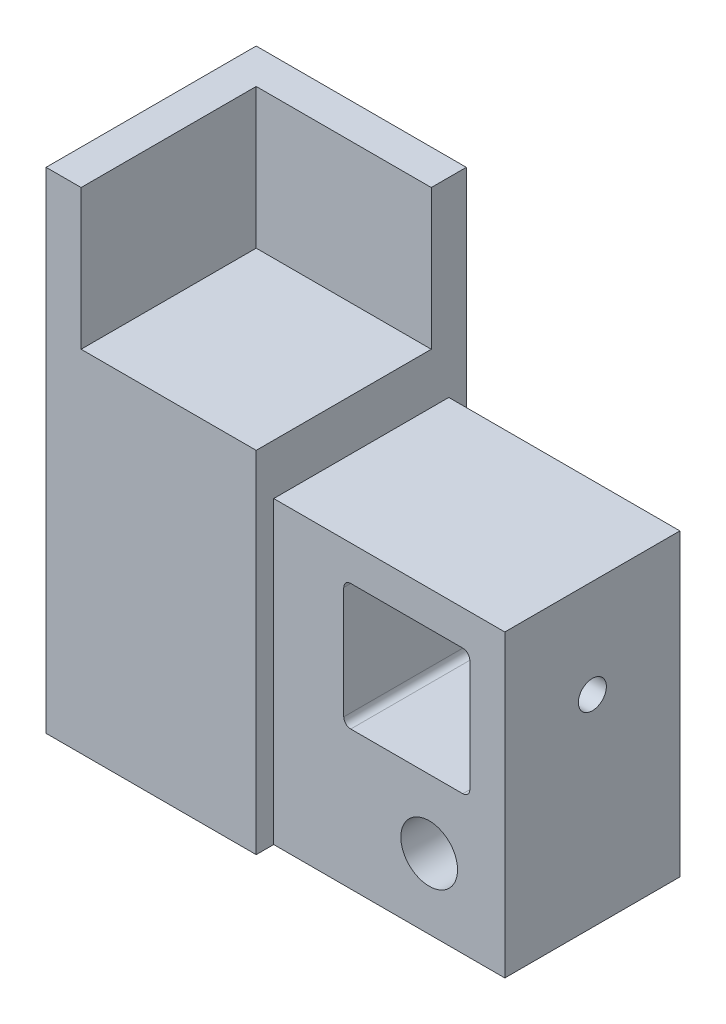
ISO-10303-21;
HEADER;
FILE_DESCRIPTION(('STEP AP214'),'2;1');
FILE_NAME('part.step','',(''),(''),'','','');
FILE_SCHEMA(('AUTOMOTIVE_DESIGN { 1 0 10303 214 1 1 1 1 }'));
ENDSEC;
DATA;
#1=APPLICATION_CONTEXT('core data for automotive mechanical design processes');
#2=APPLICATION_PROTOCOL_DEFINITION('international standard','automotive_design',2000,#1);
#3=PRODUCT_CONTEXT('',#1,'mechanical');
#4=PRODUCT('Part','Part','',(#3));
#5=PRODUCT_RELATED_PRODUCT_CATEGORY('part','',(#4));
#6=PRODUCT_DEFINITION_FORMATION('','',#4);
#7=PRODUCT_DEFINITION_CONTEXT('part definition',#1,'design');
#8=PRODUCT_DEFINITION('design','',#6,#7);
#9=PRODUCT_DEFINITION_SHAPE('','',#8);
#10=(LENGTH_UNIT() NAMED_UNIT(*) SI_UNIT(.MILLI.,.METRE.));
#11=(NAMED_UNIT(*) PLANE_ANGLE_UNIT() SI_UNIT($,.RADIAN.));
#12=(NAMED_UNIT(*) SI_UNIT($,.STERADIAN.) SOLID_ANGLE_UNIT());
#13=UNCERTAINTY_MEASURE_WITH_UNIT(LENGTH_MEASURE(1.E-05),#10,'distance_accuracy_value','');
#14=(GEOMETRIC_REPRESENTATION_CONTEXT(3) GLOBAL_UNCERTAINTY_ASSIGNED_CONTEXT((#13)) GLOBAL_UNIT_ASSIGNED_CONTEXT((#10,
#11,#12)) REPRESENTATION_CONTEXT('',''));
#15=CARTESIAN_POINT('',(0.,0.,0.));
#16=DIRECTION('',(0.,0.,1.));
#17=DIRECTION('',(1.,0.,0.));
#18=AXIS2_PLACEMENT_3D('',#15,#16,#17);
#19=CARTESIAN_POINT('',(0.,50.,0.));
#20=DIRECTION('',(0.,-1.,0.));
#21=DIRECTION('',(0.,0.,-1.));
#22=AXIS2_PLACEMENT_3D('',#19,#20,#21);
#23=PLANE('',#22);
#24=DIRECTION('',(1.,0.,0.));
#25=VECTOR('',#24,1.);
#26=CARTESIAN_POINT('',(15.,50.,-9.99999999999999));
#27=LINE('',#26,#25);
#28=CARTESIAN_POINT('',(-10.,50.,-9.99999999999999));
#29=VERTEX_POINT('',#28);
#30=CARTESIAN_POINT('',(15.,50.,-9.99999999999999));
#31=VERTEX_POINT('',#30);
#32=EDGE_CURVE('E221',#29,#31,#27,.T.);
#33=ORIENTED_EDGE('',*,*,#32,.F.);
#34=DIRECTION('',(0.,0.,-1.));
#35=VECTOR('',#34,1.);
#36=CARTESIAN_POINT('',(-10.,50.,-9.99999999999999));
#37=LINE('',#36,#35);
#38=CARTESIAN_POINT('',(-10.,50.,15.));
#39=VERTEX_POINT('',#38);
#40=EDGE_CURVE('E57',#39,#29,#37,.T.);
#41=ORIENTED_EDGE('',*,*,#40,.F.);
#42=DIRECTION('',(1.,0.,0.));
#43=VECTOR('',#42,1.);
#44=CARTESIAN_POINT('',(-15.,50.,15.));
#45=LINE('',#44,#43);
#46=CARTESIAN_POINT('',(15.,50.,15.));
#47=VERTEX_POINT('',#46);
#48=EDGE_CURVE('E340',#39,#47,#45,.T.);
#49=ORIENTED_EDGE('',*,*,#48,.T.);
#50=DIRECTION('',(0.,0.,-1.));
#51=VECTOR('',#50,1.);
#52=CARTESIAN_POINT('',(15.,50.,15.));
#53=LINE('',#52,#51);
#54=EDGE_CURVE('E62',#47,#31,#53,.T.);
#55=ORIENTED_EDGE('',*,*,#54,.T.);
#56=EDGE_LOOP('',(#33,#41,#49,#55));
#57=FACE_BOUND('',#56,.T.);
#58=ADVANCED_FACE('F40',(#57),#23,.F.);
#59=CARTESIAN_POINT('',(37.2,9.99999999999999,-12.5));
#60=DIRECTION('',(0.,0.,1.));
#61=DIRECTION('',(1.,0.,0.));
#62=AXIS2_PLACEMENT_3D('',#59,#60,#61);
#63=CYLINDRICAL_SURFACE('',#62,4.05);
#64=CARTESIAN_POINT('',(37.2,9.99999999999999,12.5));
#65=DIRECTION('',(0.,0.,1.));
#66=DIRECTION('',(1.,0.,0.));
#67=AXIS2_PLACEMENT_3D('',#64,#65,#66);
#68=CIRCLE('',#67,4.05);
#69=CARTESIAN_POINT('',(41.25,9.99999999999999,12.5));
#70=VERTEX_POINT('',#69);
#71=EDGE_CURVE('E263',#70,#70,#68,.T.);
#72=ORIENTED_EDGE('',*,*,#71,.T.);
#73=EDGE_LOOP('',(#72));
#74=FACE_BOUND('',#73,.T.);
#75=CARTESIAN_POINT('',(37.2,9.99999999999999,5.));
#76=DIRECTION('',(0.,0.,-1.));
#77=DIRECTION('',(-1.,0.,0.));
#78=AXIS2_PLACEMENT_3D('',#75,#76,#77);
#79=CIRCLE('',#78,4.05);
#80=CARTESIAN_POINT('',(33.15,9.99999999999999,5.));
#81=VERTEX_POINT('',#80);
#82=EDGE_CURVE('E13',#81,#81,#79,.F.);
#83=ORIENTED_EDGE('',*,*,#82,.F.);
#84=EDGE_LOOP('',(#83));
#85=FACE_BOUND('',#84,.T.);
#86=ADVANCED_FACE('F411',(#74,#85),#63,.F.);
#87=CARTESIAN_POINT('',(15.,50.,15.));
#88=DIRECTION('',(-1.,0.,0.));
#89=DIRECTION('',(0.,0.,1.));
#90=AXIS2_PLACEMENT_3D('',#87,#88,#89);
#91=PLANE('',#90);
#92=DIRECTION('',(0.,-1.,0.));
#93=VECTOR('',#92,1.);
#94=CARTESIAN_POINT('',(15.,42.79,12.5));
#95=LINE('',#94,#93);
#96=CARTESIAN_POINT('',(15.,42.79,12.5));
#97=VERTEX_POINT('',#96);
#98=CARTESIAN_POINT('',(15.,0.,12.5));
#99=VERTEX_POINT('',#98);
#100=EDGE_CURVE('E269',#97,#99,#95,.T.);
#101=ORIENTED_EDGE('',*,*,#100,.F.);
#102=DIRECTION('',(0.,0.,1.));
#103=VECTOR('',#102,1.);
#104=CARTESIAN_POINT('',(15.,42.79,-12.5));
#105=LINE('',#104,#103);
#106=CARTESIAN_POINT('',(15.,42.79,-12.5));
#107=VERTEX_POINT('',#106);
#108=EDGE_CURVE('E304',#107,#97,#105,.T.);
#109=ORIENTED_EDGE('',*,*,#108,.F.);
#110=DIRECTION('',(0.,-1.,0.));
#111=VECTOR('',#110,1.);
#112=CARTESIAN_POINT('',(15.,42.79,-12.5));
#113=LINE('',#112,#111);
#114=CARTESIAN_POINT('',(15.,0.,-12.5));
#115=VERTEX_POINT('',#114);
#116=EDGE_CURVE('E295',#107,#115,#113,.T.);
#117=ORIENTED_EDGE('',*,*,#116,.T.);
#118=DIRECTION('',(0.,0.,-1.));
#119=VECTOR('',#118,1.);
#120=CARTESIAN_POINT('',(15.,0.,15.));
#121=LINE('',#120,#119);
#122=CARTESIAN_POINT('',(15.,0.,-15.));
#123=VERTEX_POINT('',#122);
#124=EDGE_CURVE('E338',#115,#123,#121,.T.);
#125=ORIENTED_EDGE('',*,*,#124,.T.);
#126=DIRECTION('',(0.,-1.,0.));
#127=VECTOR('',#126,1.);
#128=CARTESIAN_POINT('',(15.,50.,-15.));
#129=LINE('',#128,#127);
#130=CARTESIAN_POINT('',(15.,70.,-15.));
#131=VERTEX_POINT('',#130);
#132=EDGE_CURVE('E206',#131,#123,#129,.T.);
#133=ORIENTED_EDGE('',*,*,#132,.F.);
#134=DIRECTION('',(0.,0.,-1.));
#135=VECTOR('',#134,1.);
#136=CARTESIAN_POINT('',(15.,70.,-15.));
#137=LINE('',#136,#135);
#138=CARTESIAN_POINT('',(15.,70.,-9.99999999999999));
#139=VERTEX_POINT('',#138);
#140=EDGE_CURVE('E220',#139,#131,#137,.T.);
#141=ORIENTED_EDGE('',*,*,#140,.F.);
#142=DIRECTION('',(0.,-1.,0.));
#143=VECTOR('',#142,1.);
#144=CARTESIAN_POINT('',(15.,70.,-9.99999999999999));
#145=LINE('',#144,#143);
#146=EDGE_CURVE('E231',#139,#31,#145,.T.);
#147=ORIENTED_EDGE('',*,*,#146,.T.);
#148=ORIENTED_EDGE('',*,*,#54,.F.);
#149=DIRECTION('',(0.,-1.,0.));
#150=VECTOR('',#149,1.);
#151=CARTESIAN_POINT('',(15.,50.,15.));
#152=LINE('',#151,#150);
#153=CARTESIAN_POINT('',(15.,0.,15.));
#154=VERTEX_POINT('',#153);
#155=EDGE_CURVE('E343',#47,#154,#152,.T.);
#156=ORIENTED_EDGE('',*,*,#155,.T.);
#157=EDGE_CURVE('E344',#154,#99,#121,.T.);
#158=ORIENTED_EDGE('',*,*,#157,.T.);
#159=EDGE_LOOP('',(#101,#109,#117,#125,#133,#141,#147,#148,#156,#158));
#160=FACE_BOUND('',#159,.T.);
#161=ADVANCED_FACE('F418',(#160),#91,.F.);
#162=CARTESIAN_POINT('',(-15.,50.,-15.));
#163=DIRECTION('',(0.,0.,1.));
#164=DIRECTION('',(1.,0.,0.));
#165=AXIS2_PLACEMENT_3D('',#162,#163,#164);
#166=PLANE('',#165);
#167=DIRECTION('',(-1.,0.,0.));
#168=VECTOR('',#167,1.);
#169=CARTESIAN_POINT('',(-15.,0.,-15.));
#170=LINE('',#169,#168);
#171=CARTESIAN_POINT('',(-15.,0.,-15.));
#172=VERTEX_POINT('',#171);
#173=EDGE_CURVE('E203',#123,#172,#170,.T.);
#174=ORIENTED_EDGE('',*,*,#173,.T.);
#175=DIRECTION('',(0.,-1.,0.));
#176=VECTOR('',#175,1.);
#177=CARTESIAN_POINT('',(-15.,50.,-15.));
#178=LINE('',#177,#176);
#179=CARTESIAN_POINT('',(-15.,70.,-15.));
#180=VERTEX_POINT('',#179);
#181=EDGE_CURVE('E196',#180,#172,#178,.T.);
#182=ORIENTED_EDGE('',*,*,#181,.F.);
#183=DIRECTION('',(-1.,0.,0.));
#184=VECTOR('',#183,1.);
#185=CARTESIAN_POINT('',(15.,70.,-15.));
#186=LINE('',#185,#184);
#187=EDGE_CURVE('E201',#131,#180,#186,.T.);
#188=ORIENTED_EDGE('',*,*,#187,.F.);
#189=ORIENTED_EDGE('',*,*,#132,.T.);
#190=EDGE_LOOP('',(#174,#182,#188,#189));
#191=FACE_BOUND('',#190,.T.);
#192=ADVANCED_FACE('F198',(#191),#166,.F.);
#193=CARTESIAN_POINT('',(-15.,50.,15.));
#194=DIRECTION('',(1.,0.,0.));
#195=DIRECTION('',(0.,0.,-1.));
#196=AXIS2_PLACEMENT_3D('',#193,#194,#195);
#197=PLANE('',#196);
#198=DIRECTION('',(0.,0.,1.));
#199=VECTOR('',#198,1.);
#200=CARTESIAN_POINT('',(-15.,0.,15.));
#201=LINE('',#200,#199);
#202=CARTESIAN_POINT('',(-15.,0.,15.));
#203=VERTEX_POINT('',#202);
#204=EDGE_CURVE('E348',#172,#203,#201,.T.);
#205=ORIENTED_EDGE('',*,*,#204,.T.);
#206=DIRECTION('',(0.,-1.,0.));
#207=VECTOR('',#206,1.);
#208=CARTESIAN_POINT('',(-15.,50.,15.));
#209=LINE('',#208,#207);
#210=CARTESIAN_POINT('',(-15.,70.,15.));
#211=VERTEX_POINT('',#210);
#212=EDGE_CURVE('E207',#211,#203,#209,.T.);
#213=ORIENTED_EDGE('',*,*,#212,.F.);
#214=DIRECTION('',(0.,0.,1.));
#215=VECTOR('',#214,1.);
#216=CARTESIAN_POINT('',(-15.,70.,-15.));
#217=LINE('',#216,#215);
#218=EDGE_CURVE('E210',#180,#211,#217,.T.);
#219=ORIENTED_EDGE('',*,*,#218,.F.);
#220=ORIENTED_EDGE('',*,*,#181,.T.);
#221=EDGE_LOOP('',(#205,#213,#219,#220));
#222=FACE_BOUND('',#221,.T.);
#223=ADVANCED_FACE('F211',(#222),#197,.F.);
#224=CARTESIAN_POINT('',(-15.,50.,15.));
#225=DIRECTION('',(0.,0.,-1.));
#226=DIRECTION('',(-1.,0.,0.));
#227=AXIS2_PLACEMENT_3D('',#224,#225,#226);
#228=PLANE('',#227);
#229=DIRECTION('',(1.,0.,0.));
#230=VECTOR('',#229,1.);
#231=CARTESIAN_POINT('',(-15.,0.,15.));
#232=LINE('',#231,#230);
#233=EDGE_CURVE('E341',#203,#154,#232,.T.);
#234=ORIENTED_EDGE('',*,*,#233,.T.);
#235=ORIENTED_EDGE('',*,*,#155,.F.);
#236=ORIENTED_EDGE('',*,*,#48,.F.);
#237=DIRECTION('',(0.,-1.,0.));
#238=VECTOR('',#237,1.);
#239=CARTESIAN_POINT('',(-10.,70.,15.));
#240=LINE('',#239,#238);
#241=CARTESIAN_POINT('',(-10.,70.,15.));
#242=VERTEX_POINT('',#241);
#243=EDGE_CURVE('E238',#242,#39,#240,.T.);
#244=ORIENTED_EDGE('',*,*,#243,.F.);
#245=DIRECTION('',(1.,0.,0.));
#246=VECTOR('',#245,1.);
#247=CARTESIAN_POINT('',(-10.,70.,15.));
#248=LINE('',#247,#246);
#249=EDGE_CURVE('E215',#211,#242,#248,.T.);
#250=ORIENTED_EDGE('',*,*,#249,.F.);
#251=ORIENTED_EDGE('',*,*,#212,.T.);
#252=EDGE_LOOP('',(#234,#235,#236,#244,#250,#251));
#253=FACE_BOUND('',#252,.T.);
#254=ADVANCED_FACE('F428',(#253),#228,.F.);
#255=CARTESIAN_POINT('',(0.,0.,0.));
#256=DIRECTION('',(0.,-1.,0.));
#257=DIRECTION('',(0.,0.,-1.));
#258=AXIS2_PLACEMENT_3D('',#255,#256,#257);
#259=PLANE('',#258);
#260=DIRECTION('',(0.,0.,1.));
#261=VECTOR('',#260,1.);
#262=CARTESIAN_POINT('',(48.,0.,-12.5));
#263=LINE('',#262,#261);
#264=CARTESIAN_POINT('',(48.,0.,-12.5));
#265=VERTEX_POINT('',#264);
#266=CARTESIAN_POINT('',(48.,0.,12.5));
#267=VERTEX_POINT('',#266);
#268=EDGE_CURVE('E308',#265,#267,#263,.T.);
#269=ORIENTED_EDGE('',*,*,#268,.T.);
#270=DIRECTION('',(1.,0.,0.));
#271=VECTOR('',#270,1.);
#272=CARTESIAN_POINT('',(48.,0.,12.5));
#273=LINE('',#272,#271);
#274=EDGE_CURVE('E271',#99,#267,#273,.T.);
#275=ORIENTED_EDGE('',*,*,#274,.F.);
#276=ORIENTED_EDGE('',*,*,#157,.F.);
#277=ORIENTED_EDGE('',*,*,#233,.F.);
#278=ORIENTED_EDGE('',*,*,#204,.F.);
#279=ORIENTED_EDGE('',*,*,#173,.F.);
#280=ORIENTED_EDGE('',*,*,#124,.F.);
#281=DIRECTION('',(1.,0.,0.));
#282=VECTOR('',#281,1.);
#283=CARTESIAN_POINT('',(48.,0.,-12.5));
#284=LINE('',#283,#282);
#285=EDGE_CURVE('E298',#115,#265,#284,.T.);
#286=ORIENTED_EDGE('',*,*,#285,.T.);
#287=EDGE_LOOP('',(#269,#275,#276,#277,#278,#279,#280,#286));
#288=FACE_BOUND('',#287,.T.);
#289=DIRECTION('',(0.,0.,1.));
#290=VECTOR('',#289,1.);
#291=CARTESIAN_POINT('',(10.,0.,-10.));
#292=LINE('',#291,#290);
#293=CARTESIAN_POINT('',(10.,0.,-10.));
#294=VERTEX_POINT('',#293);
#295=CARTESIAN_POINT('',(10.,0.,10.));
#296=VERTEX_POINT('',#295);
#297=EDGE_CURVE('E307',#294,#296,#292,.T.);
#298=ORIENTED_EDGE('',*,*,#297,.F.);
#299=DIRECTION('',(1.,0.,0.));
#300=VECTOR('',#299,1.);
#301=CARTESIAN_POINT('',(-10.,0.,-10.));
#302=LINE('',#301,#300);
#303=CARTESIAN_POINT('',(-10.,0.,-10.));
#304=VERTEX_POINT('',#303);
#305=EDGE_CURVE('E326',#304,#294,#302,.T.);
#306=ORIENTED_EDGE('',*,*,#305,.F.);
#307=DIRECTION('',(0.,0.,-1.));
#308=VECTOR('',#307,1.);
#309=CARTESIAN_POINT('',(-10.,0.,-10.));
#310=LINE('',#309,#308);
#311=CARTESIAN_POINT('',(-10.,0.,10.));
#312=VERTEX_POINT('',#311);
#313=EDGE_CURVE('E323',#312,#304,#310,.T.);
#314=ORIENTED_EDGE('',*,*,#313,.F.);
#315=DIRECTION('',(-1.,0.,0.));
#316=VECTOR('',#315,1.);
#317=CARTESIAN_POINT('',(-10.,0.,10.));
#318=LINE('',#317,#316);
#319=EDGE_CURVE('E320',#296,#312,#318,.T.);
#320=ORIENTED_EDGE('',*,*,#319,.F.);
#321=EDGE_LOOP('',(#298,#306,#314,#320));
#322=FACE_BOUND('',#321,.T.);
#323=ADVANCED_FACE('F425',(#288,#322),#259,.T.);
#324=CARTESIAN_POINT('',(10.,78.2842712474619,-10.));
#325=DIRECTION('',(1.,0.,0.));
#326=DIRECTION('',(0.,0.,-1.));
#327=AXIS2_PLACEMENT_3D('',#324,#325,#326);
#328=PLANE('',#327);
#329=DIRECTION('',(0.,0.,-1.));
#330=VECTOR('',#329,1.);
#331=CARTESIAN_POINT('',(10.,45.,-10.));
#332=LINE('',#331,#330);
#333=CARTESIAN_POINT('',(10.,45.,10.));
#334=VERTEX_POINT('',#333);
#335=CARTESIAN_POINT('',(10.,45.,-10.));
#336=VERTEX_POINT('',#335);
#337=EDGE_CURVE('E316',#334,#336,#332,.T.);
#338=ORIENTED_EDGE('',*,*,#337,.T.);
#339=DIRECTION('',(0.,-1.,0.));
#340=VECTOR('',#339,1.);
#341=CARTESIAN_POINT('',(10.,78.2842712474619,-10.));
#342=LINE('',#341,#340);
#343=EDGE_CURVE('E314',#336,#294,#342,.T.);
#344=ORIENTED_EDGE('',*,*,#343,.T.);
#345=ORIENTED_EDGE('',*,*,#297,.T.);
#346=DIRECTION('',(0.,-1.,0.));
#347=VECTOR('',#346,1.);
#348=CARTESIAN_POINT('',(10.,78.2842712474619,10.));
#349=LINE('',#348,#347);
#350=EDGE_CURVE('E329',#334,#296,#349,.T.);
#351=ORIENTED_EDGE('',*,*,#350,.F.);
#352=EDGE_LOOP('',(#338,#344,#345,#351));
#353=FACE_BOUND('',#352,.T.);
#354=ADVANCED_FACE('F423',(#353),#328,.F.);
#355=CARTESIAN_POINT('',(-10.,78.2842712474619,-10.));
#356=DIRECTION('',(0.,0.,-1.));
#357=DIRECTION('',(-1.,0.,0.));
#358=AXIS2_PLACEMENT_3D('',#355,#356,#357);
#359=PLANE('',#358);
#360=DIRECTION('',(-1.,0.,0.));
#361=VECTOR('',#360,1.);
#362=CARTESIAN_POINT('',(-10.,45.,-10.));
#363=LINE('',#362,#361);
#364=CARTESIAN_POINT('',(-10.,45.,-10.));
#365=VERTEX_POINT('',#364);
#366=EDGE_CURVE('E313',#336,#365,#363,.T.);
#367=ORIENTED_EDGE('',*,*,#366,.T.);
#368=DIRECTION('',(0.,-1.,0.));
#369=VECTOR('',#368,1.);
#370=CARTESIAN_POINT('',(-10.,78.2842712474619,-10.));
#371=LINE('',#370,#369);
#372=EDGE_CURVE('E331',#365,#304,#371,.T.);
#373=ORIENTED_EDGE('',*,*,#372,.T.);
#374=ORIENTED_EDGE('',*,*,#305,.T.);
#375=ORIENTED_EDGE('',*,*,#343,.F.);
#376=EDGE_LOOP('',(#367,#373,#374,#375));
#377=FACE_BOUND('',#376,.T.);
#378=ADVANCED_FACE('F520',(#377),#359,.F.);
#379=CARTESIAN_POINT('',(-10.,78.2842712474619,-10.));
#380=DIRECTION('',(-1.,0.,0.));
#381=DIRECTION('',(0.,0.,1.));
#382=AXIS2_PLACEMENT_3D('',#379,#380,#381);
#383=PLANE('',#382);
#384=DIRECTION('',(0.,0.,1.));
#385=VECTOR('',#384,1.);
#386=CARTESIAN_POINT('',(-10.,45.,-10.));
#387=LINE('',#386,#385);
#388=CARTESIAN_POINT('',(-10.,45.,10.));
#389=VERTEX_POINT('',#388);
#390=EDGE_CURVE('E311',#365,#389,#387,.T.);
#391=ORIENTED_EDGE('',*,*,#390,.T.);
#392=DIRECTION('',(0.,-1.,0.));
#393=VECTOR('',#392,1.);
#394=CARTESIAN_POINT('',(-10.,78.2842712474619,10.));
#395=LINE('',#394,#393);
#396=EDGE_CURVE('E333',#389,#312,#395,.T.);
#397=ORIENTED_EDGE('',*,*,#396,.T.);
#398=ORIENTED_EDGE('',*,*,#313,.T.);
#399=ORIENTED_EDGE('',*,*,#372,.F.);
#400=EDGE_LOOP('',(#391,#397,#398,#399));
#401=FACE_BOUND('',#400,.T.);
#402=ADVANCED_FACE('F523',(#401),#383,.F.);
#403=CARTESIAN_POINT('',(-10.,78.2842712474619,10.));
#404=DIRECTION('',(0.,0.,1.));
#405=DIRECTION('',(1.,0.,0.));
#406=AXIS2_PLACEMENT_3D('',#403,#404,#405);
#407=PLANE('',#406);
#408=DIRECTION('',(1.,0.,0.));
#409=VECTOR('',#408,1.);
#410=CARTESIAN_POINT('',(-10.,45.,10.));
#411=LINE('',#410,#409);
#412=EDGE_CURVE('E318',#389,#334,#411,.T.);
#413=ORIENTED_EDGE('',*,*,#412,.T.);
#414=ORIENTED_EDGE('',*,*,#350,.T.);
#415=ORIENTED_EDGE('',*,*,#319,.T.);
#416=ORIENTED_EDGE('',*,*,#396,.F.);
#417=EDGE_LOOP('',(#413,#414,#415,#416));
#418=FACE_BOUND('',#417,.T.);
#419=ADVANCED_FACE('F518',(#418),#407,.F.);
#420=CARTESIAN_POINT('',(0.,45.,0.));
#421=DIRECTION('',(0.,-1.,0.));
#422=DIRECTION('',(0.,0.,-1.));
#423=AXIS2_PLACEMENT_3D('',#420,#421,#422);
#424=PLANE('',#423);
#425=ORIENTED_EDGE('',*,*,#337,.F.);
#426=ORIENTED_EDGE('',*,*,#412,.F.);
#427=ORIENTED_EDGE('',*,*,#390,.F.);
#428=ORIENTED_EDGE('',*,*,#366,.F.);
#429=EDGE_LOOP('',(#425,#426,#427,#428));
#430=FACE_BOUND('',#429,.T.);
#431=ADVANCED_FACE('F514',(#430),#424,.T.);
#432=CARTESIAN_POINT('',(15.,42.79,-12.5));
#433=DIRECTION('',(0.,1.,0.));
#434=DIRECTION('',(0.,0.,1.));
#435=AXIS2_PLACEMENT_3D('',#432,#433,#434);
#436=PLANE('',#435);
#437=ORIENTED_EDGE('',*,*,#108,.T.);
#438=DIRECTION('',(-1.,0.,0.));
#439=VECTOR('',#438,1.);
#440=CARTESIAN_POINT('',(15.,42.79,12.5));
#441=LINE('',#440,#439);
#442=CARTESIAN_POINT('',(48.,42.79,12.5));
#443=VERTEX_POINT('',#442);
#444=EDGE_CURVE('E266',#443,#97,#441,.T.);
#445=ORIENTED_EDGE('',*,*,#444,.F.);
#446=DIRECTION('',(0.,0.,1.));
#447=VECTOR('',#446,1.);
#448=CARTESIAN_POINT('',(48.,42.79,-12.5));
#449=LINE('',#448,#447);
#450=CARTESIAN_POINT('',(48.,42.79,-12.5));
#451=VERTEX_POINT('',#450);
#452=EDGE_CURVE('E305',#451,#443,#449,.T.);
#453=ORIENTED_EDGE('',*,*,#452,.F.);
#454=DIRECTION('',(-1.,0.,0.));
#455=VECTOR('',#454,1.);
#456=CARTESIAN_POINT('',(15.,42.79,-12.5));
#457=LINE('',#456,#455);
#458=EDGE_CURVE('E292',#451,#107,#457,.T.);
#459=ORIENTED_EDGE('',*,*,#458,.T.);
#460=EDGE_LOOP('',(#437,#445,#453,#459));
#461=FACE_BOUND('',#460,.T.);
#462=ADVANCED_FACE('F510',(#461),#436,.T.);
#463=CARTESIAN_POINT('',(48.,42.79,-12.5));
#464=DIRECTION('',(1.,0.,0.));
#465=DIRECTION('',(0.,1.,0.));
#466=AXIS2_PLACEMENT_3D('',#463,#464,#465);
#467=PLANE('',#466);
#468=CARTESIAN_POINT('',(48.,28.8,0.));
#469=DIRECTION('',(1.,0.,0.));
#470=DIRECTION('',(0.,1.,0.));
#471=AXIS2_PLACEMENT_3D('',#468,#469,#470);
#472=CIRCLE('',#471,2.);
#473=CARTESIAN_POINT('',(48.,30.8,0.));
#474=VERTEX_POINT('',#473);
#475=EDGE_CURVE('E241',#474,#474,#472,.T.);
#476=ORIENTED_EDGE('',*,*,#475,.F.);
#477=EDGE_LOOP('',(#476));
#478=FACE_BOUND('',#477,.T.);
#479=DIRECTION('',(0.,1.,0.));
#480=VECTOR('',#479,1.);
#481=CARTESIAN_POINT('',(48.,42.79,12.5));
#482=LINE('',#481,#480);
#483=EDGE_CURVE('E274',#267,#443,#482,.T.);
#484=ORIENTED_EDGE('',*,*,#483,.F.);
#485=ORIENTED_EDGE('',*,*,#268,.F.);
#486=DIRECTION('',(0.,1.,0.));
#487=VECTOR('',#486,1.);
#488=CARTESIAN_POINT('',(48.,42.79,-12.5));
#489=LINE('',#488,#487);
#490=EDGE_CURVE('E301',#265,#451,#489,.T.);
#491=ORIENTED_EDGE('',*,*,#490,.T.);
#492=ORIENTED_EDGE('',*,*,#452,.T.);
#493=EDGE_LOOP('',(#484,#485,#491,#492));
#494=FACE_BOUND('',#493,.T.);
#495=ADVANCED_FACE('F507',(#478,#494),#467,.T.);
#496=CARTESIAN_POINT('',(0.,0.,-12.5));
#497=DIRECTION('',(0.,0.,-1.));
#498=DIRECTION('',(-1.,0.,0.));
#499=AXIS2_PLACEMENT_3D('',#496,#497,#498);
#500=PLANE('',#499);
#501=DIRECTION('',(0.,1.,0.));
#502=VECTOR('',#501,1.);
#503=CARTESIAN_POINT('',(43.,37.79,-12.5));
#504=LINE('',#503,#502);
#505=CARTESIAN_POINT('',(43.,20.79,-12.5));
#506=VERTEX_POINT('',#505);
#507=CARTESIAN_POINT('',(43.,36.79,-12.5));
#508=VERTEX_POINT('',#507);
#509=EDGE_CURVE('E286',#506,#508,#504,.T.);
#510=ORIENTED_EDGE('',*,*,#509,.T.);
#511=CARTESIAN_POINT('',(42.,36.79,-12.5));
#512=DIRECTION('',(0.,0.,-1.));
#513=DIRECTION('',(-1.,0.,0.));
#514=AXIS2_PLACEMENT_3D('',#511,#512,#513);
#515=CIRCLE('',#514,1.);
#516=CARTESIAN_POINT('',(42.,37.79,-12.5));
#517=VERTEX_POINT('',#516);
#518=EDGE_CURVE('E49',#508,#517,#515,.F.);
#519=ORIENTED_EDGE('',*,*,#518,.T.);
#520=DIRECTION('',(-1.,0.,0.));
#521=VECTOR('',#520,1.);
#522=CARTESIAN_POINT('',(25.,37.79,-12.5));
#523=LINE('',#522,#521);
#524=CARTESIAN_POINT('',(26.,37.79,-12.5));
#525=VERTEX_POINT('',#524);
#526=EDGE_CURVE('E277',#517,#525,#523,.T.);
#527=ORIENTED_EDGE('',*,*,#526,.T.);
#528=CARTESIAN_POINT('',(26.,36.79,-12.5));
#529=DIRECTION('',(0.,0.,-1.));
#530=DIRECTION('',(-1.,0.,0.));
#531=AXIS2_PLACEMENT_3D('',#528,#529,#530);
#532=CIRCLE('',#531,1.);
#533=CARTESIAN_POINT('',(25.,36.79,-12.5));
#534=VERTEX_POINT('',#533);
#535=EDGE_CURVE('E385',#525,#534,#532,.F.);
#536=ORIENTED_EDGE('',*,*,#535,.T.);
#537=DIRECTION('',(0.,-1.,0.));
#538=VECTOR('',#537,1.);
#539=CARTESIAN_POINT('',(25.,37.79,-12.5));
#540=LINE('',#539,#538);
#541=CARTESIAN_POINT('',(25.,20.79,-12.5));
#542=VERTEX_POINT('',#541);
#543=EDGE_CURVE('E280',#534,#542,#540,.T.);
#544=ORIENTED_EDGE('',*,*,#543,.T.);
#545=CARTESIAN_POINT('',(26.,20.79,-12.5));
#546=DIRECTION('',(0.,0.,-1.));
#547=DIRECTION('',(-1.,0.,0.));
#548=AXIS2_PLACEMENT_3D('',#545,#546,#547);
#549=CIRCLE('',#548,1.);
#550=CARTESIAN_POINT('',(26.,19.79,-12.5));
#551=VERTEX_POINT('',#550);
#552=EDGE_CURVE('E381',#542,#551,#549,.F.);
#553=ORIENTED_EDGE('',*,*,#552,.T.);
#554=DIRECTION('',(1.,0.,0.));
#555=VECTOR('',#554,1.);
#556=CARTESIAN_POINT('',(25.,19.79,-12.5));
#557=LINE('',#556,#555);
#558=CARTESIAN_POINT('',(42.,19.79,-12.5));
#559=VERTEX_POINT('',#558);
#560=EDGE_CURVE('E283',#551,#559,#557,.T.);
#561=ORIENTED_EDGE('',*,*,#560,.T.);
#562=CARTESIAN_POINT('',(42.,20.79,-12.5));
#563=DIRECTION('',(0.,0.,-1.));
#564=DIRECTION('',(-1.,0.,0.));
#565=AXIS2_PLACEMENT_3D('',#562,#563,#564);
#566=CIRCLE('',#565,1.);
#567=EDGE_CURVE('E377',#559,#506,#566,.F.);
#568=ORIENTED_EDGE('',*,*,#567,.T.);
#569=EDGE_LOOP('',(#510,#519,#527,#536,#544,#553,#561,#568));
#570=FACE_BOUND('',#569,.T.);
#571=CARTESIAN_POINT('',(37.2,9.99999999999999,-12.5));
#572=DIRECTION('',(0.,0.,1.));
#573=DIRECTION('',(1.,0.,0.));
#574=AXIS2_PLACEMENT_3D('',#571,#572,#573);
#575=CIRCLE('',#574,4.05);
#576=CARTESIAN_POINT('',(41.25,9.99999999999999,-12.5));
#577=VERTEX_POINT('',#576);
#578=EDGE_CURVE('E289',#577,#577,#575,.T.);
#579=ORIENTED_EDGE('',*,*,#578,.T.);
#580=EDGE_LOOP('',(#579));
#581=FACE_BOUND('',#580,.T.);
#582=ORIENTED_EDGE('',*,*,#458,.F.);
#583=ORIENTED_EDGE('',*,*,#490,.F.);
#584=ORIENTED_EDGE('',*,*,#285,.F.);
#585=ORIENTED_EDGE('',*,*,#116,.F.);
#586=EDGE_LOOP('',(#582,#583,#584,#585));
#587=FACE_BOUND('',#586,.T.);
#588=ADVANCED_FACE('F460',(#570,#581,#587),#500,.T.);
#589=CARTESIAN_POINT('',(37.2,9.99999999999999,-2.5));
#590=DIRECTION('',(0.,0.,-1.));
#591=DIRECTION('',(-1.,0.,0.));
#592=AXIS2_PLACEMENT_3D('',#589,#590,#591);
#593=CIRCLE('',#592,4.05);
#594=CARTESIAN_POINT('',(33.15,9.99999999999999,-2.5));
#595=VERTEX_POINT('',#594);
#596=EDGE_CURVE('E250',#595,#595,#593,.F.);
#597=ORIENTED_EDGE('',*,*,#596,.T.);
#598=EDGE_LOOP('',(#597));
#599=FACE_BOUND('',#598,.T.);
#600=ORIENTED_EDGE('',*,*,#578,.F.);
#601=EDGE_LOOP('',(#600));
#602=FACE_BOUND('',#601,.T.);
#603=ADVANCED_FACE('F392',(#599,#602),#63,.F.);
#604=CARTESIAN_POINT('',(25.,37.79,-12.5));
#605=DIRECTION('',(0.,1.,0.));
#606=DIRECTION('',(-1.,0.,0.));
#607=AXIS2_PLACEMENT_3D('',#604,#605,#606);
#608=PLANE('',#607);
#609=DIRECTION('',(-1.,0.,0.));
#610=VECTOR('',#609,1.);
#611=CARTESIAN_POINT('',(25.,37.79,12.5));
#612=LINE('',#611,#610);
#613=CARTESIAN_POINT('',(42.,37.79,12.5));
#614=VERTEX_POINT('',#613);
#615=CARTESIAN_POINT('',(26.,37.79,12.5));
#616=VERTEX_POINT('',#615);
#617=EDGE_CURVE('E251',#614,#616,#612,.T.);
#618=ORIENTED_EDGE('',*,*,#617,.T.);
#619=DIRECTION('',(0.,0.,1.));
#620=VECTOR('',#619,1.);
#621=CARTESIAN_POINT('',(26.,37.79,-12.5));
#622=LINE('',#621,#620);
#623=EDGE_CURVE('E373',#616,#525,#622,.F.);
#624=ORIENTED_EDGE('',*,*,#623,.T.);
#625=ORIENTED_EDGE('',*,*,#526,.F.);
#626=DIRECTION('',(0.,0.,1.));
#627=VECTOR('',#626,1.);
#628=CARTESIAN_POINT('',(42.,37.79,12.5));
#629=LINE('',#628,#627);
#630=EDGE_CURVE('E370',#517,#614,#629,.T.);
#631=ORIENTED_EDGE('',*,*,#630,.T.);
#632=EDGE_LOOP('',(#618,#624,#625,#631));
#633=FACE_BOUND('',#632,.T.);
#634=ADVANCED_FACE('F484',(#633),#608,.F.);
#635=CARTESIAN_POINT('',(43.,37.79,-12.5));
#636=DIRECTION('',(1.,0.,0.));
#637=DIRECTION('',(0.,0.,-1.));
#638=AXIS2_PLACEMENT_3D('',#635,#636,#637);
#639=PLANE('',#638);
#640=CARTESIAN_POINT('',(43.,28.8,0.));
#641=DIRECTION('',(1.,0.,0.));
#642=DIRECTION('',(0.,0.,-1.));
#643=AXIS2_PLACEMENT_3D('',#640,#641,#642);
#644=CIRCLE('',#643,2.);
#645=CARTESIAN_POINT('',(43.,28.8,-2.));
#646=VERTEX_POINT('',#645);
#647=EDGE_CURVE('E247',#646,#646,#644,.T.);
#648=ORIENTED_EDGE('',*,*,#647,.T.);
#649=EDGE_LOOP('',(#648));
#650=FACE_BOUND('',#649,.T.);
#651=ORIENTED_EDGE('',*,*,#509,.F.);
#652=DIRECTION('',(0.,0.,1.));
#653=VECTOR('',#652,1.);
#654=CARTESIAN_POINT('',(43.,20.79,12.5));
#655=LINE('',#654,#653);
#656=CARTESIAN_POINT('',(43.,20.79,12.5));
#657=VERTEX_POINT('',#656);
#658=EDGE_CURVE('E357',#506,#657,#655,.T.);
#659=ORIENTED_EDGE('',*,*,#658,.T.);
#660=DIRECTION('',(0.,1.,0.));
#661=VECTOR('',#660,1.);
#662=CARTESIAN_POINT('',(43.,37.79,12.5));
#663=LINE('',#662,#661);
#664=CARTESIAN_POINT('',(43.,36.79,12.5));
#665=VERTEX_POINT('',#664);
#666=EDGE_CURVE('E260',#657,#665,#663,.T.);
#667=ORIENTED_EDGE('',*,*,#666,.T.);
#668=DIRECTION('',(0.,0.,1.));
#669=VECTOR('',#668,1.);
#670=CARTESIAN_POINT('',(43.,36.79,-12.5));
#671=LINE('',#670,#669);
#672=EDGE_CURVE('E355',#665,#508,#671,.F.);
#673=ORIENTED_EDGE('',*,*,#672,.T.);
#674=EDGE_LOOP('',(#651,#659,#667,#673));
#675=FACE_BOUND('',#674,.T.);
#676=ADVANCED_FACE('F479',(#650,#675),#639,.F.);
#677=CARTESIAN_POINT('',(25.,19.79,-12.5));
#678=DIRECTION('',(0.,-1.,0.));
#679=DIRECTION('',(1.,0.,0.));
#680=AXIS2_PLACEMENT_3D('',#677,#678,#679);
#681=PLANE('',#680);
#682=DIRECTION('',(1.,0.,0.));
#683=VECTOR('',#682,1.);
#684=CARTESIAN_POINT('',(25.,19.79,12.5));
#685=LINE('',#684,#683);
#686=CARTESIAN_POINT('',(26.,19.79,12.5));
#687=VERTEX_POINT('',#686);
#688=CARTESIAN_POINT('',(42.,19.79,12.5));
#689=VERTEX_POINT('',#688);
#690=EDGE_CURVE('E257',#687,#689,#685,.T.);
#691=ORIENTED_EDGE('',*,*,#690,.T.);
#692=DIRECTION('',(0.,0.,1.));
#693=VECTOR('',#692,1.);
#694=CARTESIAN_POINT('',(42.,19.79,-12.5));
#695=LINE('',#694,#693);
#696=EDGE_CURVE('E363',#689,#559,#695,.F.);
#697=ORIENTED_EDGE('',*,*,#696,.T.);
#698=ORIENTED_EDGE('',*,*,#560,.F.);
#699=DIRECTION('',(0.,0.,1.));
#700=VECTOR('',#699,1.);
#701=CARTESIAN_POINT('',(26.,19.79,12.5));
#702=LINE('',#701,#700);
#703=EDGE_CURVE('E360',#551,#687,#702,.T.);
#704=ORIENTED_EDGE('',*,*,#703,.T.);
#705=EDGE_LOOP('',(#691,#697,#698,#704));
#706=FACE_BOUND('',#705,.T.);
#707=ADVANCED_FACE('F472',(#706),#681,.F.);
#708=CARTESIAN_POINT('',(25.,37.79,-12.5));
#709=DIRECTION('',(-1.,0.,0.));
#710=DIRECTION('',(0.,-1.,0.));
#711=AXIS2_PLACEMENT_3D('',#708,#709,#710);
#712=PLANE('',#711);
#713=CARTESIAN_POINT('',(25.,28.8,0.));
#714=DIRECTION('',(-1.,0.,0.));
#715=DIRECTION('',(0.,-1.,0.));
#716=AXIS2_PLACEMENT_3D('',#713,#714,#715);
#717=CIRCLE('',#716,2.);
#718=CARTESIAN_POINT('',(25.,26.8,0.));
#719=VERTEX_POINT('',#718);
#720=EDGE_CURVE('E44',#719,#719,#717,.T.);
#721=ORIENTED_EDGE('',*,*,#720,.T.);
#722=EDGE_LOOP('',(#721));
#723=FACE_BOUND('',#722,.T.);
#724=DIRECTION('',(0.,-1.,0.));
#725=VECTOR('',#724,1.);
#726=CARTESIAN_POINT('',(25.,37.79,12.5));
#727=LINE('',#726,#725);
#728=CARTESIAN_POINT('',(25.,36.79,12.5));
#729=VERTEX_POINT('',#728);
#730=CARTESIAN_POINT('',(25.,20.79,12.5));
#731=VERTEX_POINT('',#730);
#732=EDGE_CURVE('E254',#729,#731,#727,.T.);
#733=ORIENTED_EDGE('',*,*,#732,.T.);
#734=DIRECTION('',(0.,0.,1.));
#735=VECTOR('',#734,1.);
#736=CARTESIAN_POINT('',(25.,20.79,-12.5));
#737=LINE('',#736,#735);
#738=EDGE_CURVE('E368',#731,#542,#737,.F.);
#739=ORIENTED_EDGE('',*,*,#738,.T.);
#740=ORIENTED_EDGE('',*,*,#543,.F.);
#741=DIRECTION('',(0.,0.,1.));
#742=VECTOR('',#741,1.);
#743=CARTESIAN_POINT('',(25.,36.79,12.5));
#744=LINE('',#743,#742);
#745=EDGE_CURVE('E365',#534,#729,#744,.T.);
#746=ORIENTED_EDGE('',*,*,#745,.T.);
#747=EDGE_LOOP('',(#733,#739,#740,#746));
#748=FACE_BOUND('',#747,.T.);
#749=ADVANCED_FACE('F465',(#723,#748),#712,.F.);
#750=CARTESIAN_POINT('',(0.,0.,12.5));
#751=DIRECTION('',(0.,0.,-1.));
#752=DIRECTION('',(-1.,0.,0.));
#753=AXIS2_PLACEMENT_3D('',#750,#751,#752);
#754=PLANE('',#753);
#755=ORIENTED_EDGE('',*,*,#71,.F.);
#756=EDGE_LOOP('',(#755));
#757=FACE_BOUND('',#756,.T.);
#758=ORIENTED_EDGE('',*,*,#444,.T.);
#759=ORIENTED_EDGE('',*,*,#100,.T.);
#760=ORIENTED_EDGE('',*,*,#274,.T.);
#761=ORIENTED_EDGE('',*,*,#483,.T.);
#762=EDGE_LOOP('',(#758,#759,#760,#761));
#763=FACE_BOUND('',#762,.T.);
#764=ORIENTED_EDGE('',*,*,#617,.F.);
#765=CARTESIAN_POINT('',(42.,36.79,12.5));
#766=DIRECTION('',(0.,0.,-1.));
#767=DIRECTION('',(-1.,0.,0.));
#768=AXIS2_PLACEMENT_3D('',#765,#766,#767);
#769=CIRCLE('',#768,1.);
#770=EDGE_CURVE('E387',#614,#665,#769,.T.);
#771=ORIENTED_EDGE('',*,*,#770,.T.);
#772=ORIENTED_EDGE('',*,*,#666,.F.);
#773=CARTESIAN_POINT('',(42.,20.79,12.5));
#774=DIRECTION('',(0.,0.,-1.));
#775=DIRECTION('',(-1.,0.,0.));
#776=AXIS2_PLACEMENT_3D('',#773,#774,#775);
#777=CIRCLE('',#776,1.);
#778=EDGE_CURVE('E375',#657,#689,#777,.T.);
#779=ORIENTED_EDGE('',*,*,#778,.T.);
#780=ORIENTED_EDGE('',*,*,#690,.F.);
#781=CARTESIAN_POINT('',(26.,20.79,12.5));
#782=DIRECTION('',(0.,0.,-1.));
#783=DIRECTION('',(-1.,0.,0.));
#784=AXIS2_PLACEMENT_3D('',#781,#782,#783);
#785=CIRCLE('',#784,1.);
#786=EDGE_CURVE('E379',#687,#731,#785,.T.);
#787=ORIENTED_EDGE('',*,*,#786,.T.);
#788=ORIENTED_EDGE('',*,*,#732,.F.);
#789=CARTESIAN_POINT('',(26.,36.79,12.5));
#790=DIRECTION('',(0.,0.,-1.));
#791=DIRECTION('',(-1.,0.,0.));
#792=AXIS2_PLACEMENT_3D('',#789,#790,#791);
#793=CIRCLE('',#792,1.);
#794=EDGE_CURVE('E383',#729,#616,#793,.T.);
#795=ORIENTED_EDGE('',*,*,#794,.T.);
#796=EDGE_LOOP('',(#764,#771,#772,#779,#780,#787,#788,#795));
#797=FACE_BOUND('',#796,.T.);
#798=ADVANCED_FACE('F444',(#757,#763,#797),#754,.F.);
#799=CARTESIAN_POINT('',(42.,20.79,-12.5));
#800=DIRECTION('',(0.,0.,-1.));
#801=DIRECTION('',(-1.,0.,0.));
#802=AXIS2_PLACEMENT_3D('',#799,#800,#801);
#803=CYLINDRICAL_SURFACE('',#802,1.);
#804=ORIENTED_EDGE('',*,*,#567,.F.);
#805=ORIENTED_EDGE('',*,*,#696,.F.);
#806=ORIENTED_EDGE('',*,*,#778,.F.);
#807=ORIENTED_EDGE('',*,*,#658,.F.);
#808=EDGE_LOOP('',(#804,#805,#806,#807));
#809=FACE_BOUND('',#808,.T.);
#810=ADVANCED_FACE('F440',(#809),#803,.F.);
#811=CARTESIAN_POINT('',(26.,20.79,-12.5));
#812=DIRECTION('',(0.,0.,-1.));
#813=DIRECTION('',(-1.,0.,0.));
#814=AXIS2_PLACEMENT_3D('',#811,#812,#813);
#815=CYLINDRICAL_SURFACE('',#814,1.);
#816=ORIENTED_EDGE('',*,*,#552,.F.);
#817=ORIENTED_EDGE('',*,*,#738,.F.);
#818=ORIENTED_EDGE('',*,*,#786,.F.);
#819=ORIENTED_EDGE('',*,*,#703,.F.);
#820=EDGE_LOOP('',(#816,#817,#818,#819));
#821=FACE_BOUND('',#820,.T.);
#822=ADVANCED_FACE('F443',(#821),#815,.F.);
#823=CARTESIAN_POINT('',(26.,36.79,-12.5));
#824=DIRECTION('',(0.,0.,-1.));
#825=DIRECTION('',(-1.,0.,0.));
#826=AXIS2_PLACEMENT_3D('',#823,#824,#825);
#827=CYLINDRICAL_SURFACE('',#826,1.);
#828=ORIENTED_EDGE('',*,*,#535,.F.);
#829=ORIENTED_EDGE('',*,*,#623,.F.);
#830=ORIENTED_EDGE('',*,*,#794,.F.);
#831=ORIENTED_EDGE('',*,*,#745,.F.);
#832=EDGE_LOOP('',(#828,#829,#830,#831));
#833=FACE_BOUND('',#832,.T.);
#834=ADVANCED_FACE('F447',(#833),#827,.F.);
#835=CARTESIAN_POINT('',(42.,36.79,-12.5));
#836=DIRECTION('',(0.,0.,-1.));
#837=DIRECTION('',(-1.,0.,0.));
#838=AXIS2_PLACEMENT_3D('',#835,#836,#837);
#839=CYLINDRICAL_SURFACE('',#838,1.);
#840=ORIENTED_EDGE('',*,*,#518,.F.);
#841=ORIENTED_EDGE('',*,*,#672,.F.);
#842=ORIENTED_EDGE('',*,*,#770,.F.);
#843=ORIENTED_EDGE('',*,*,#630,.F.);
#844=EDGE_LOOP('',(#840,#841,#842,#843));
#845=FACE_BOUND('',#844,.T.);
#846=ADVANCED_FACE('F42',(#845),#839,.F.);
#847=CARTESIAN_POINT('',(-15.,50.,5.));
#848=DIRECTION('',(0.,0.,-1.));
#849=DIRECTION('',(-1.,0.,0.));
#850=AXIS2_PLACEMENT_3D('',#847,#848,#849);
#851=PLANE('',#850);
#852=ORIENTED_EDGE('',*,*,#82,.T.);
#853=EDGE_LOOP('',(#852));
#854=FACE_BOUND('',#853,.T.);
#855=ADVANCED_FACE('F398',(#854),#851,.F.);
#856=CARTESIAN_POINT('',(0.,0.,-2.5));
#857=DIRECTION('',(0.,0.,-1.));
#858=DIRECTION('',(-1.,0.,0.));
#859=AXIS2_PLACEMENT_3D('',#856,#857,#858);
#860=PLANE('',#859);
#861=ORIENTED_EDGE('',*,*,#596,.F.);
#862=EDGE_LOOP('',(#861));
#863=FACE_BOUND('',#862,.T.);
#864=ADVANCED_FACE('F395',(#863),#860,.T.);
#865=CARTESIAN_POINT('',(20.,37.79,-12.5));
#866=DIRECTION('',(-1.,0.,0.));
#867=DIRECTION('',(0.,-1.,0.));
#868=AXIS2_PLACEMENT_3D('',#865,#866,#867);
#869=PLANE('',#868);
#870=CARTESIAN_POINT('',(20.,28.8,0.));
#871=DIRECTION('',(-1.,0.,0.));
#872=DIRECTION('',(0.,-1.,0.));
#873=AXIS2_PLACEMENT_3D('',#870,#871,#872);
#874=CIRCLE('',#873,2.);
#875=CARTESIAN_POINT('',(20.,26.8,0.));
#876=VERTEX_POINT('',#875);
#877=EDGE_CURVE('E244',#876,#876,#874,.F.);
#878=ORIENTED_EDGE('',*,*,#877,.T.);
#879=EDGE_LOOP('',(#878));
#880=FACE_BOUND('',#879,.T.);
#881=ADVANCED_FACE('F397',(#880),#869,.F.);
#882=CARTESIAN_POINT('',(9.34314575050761,28.8,0.));
#883=DIRECTION('',(1.,0.,0.));
#884=DIRECTION('',(0.,1.,0.));
#885=AXIS2_PLACEMENT_3D('',#882,#883,#884);
#886=CYLINDRICAL_SURFACE('',#885,2.);
#887=ORIENTED_EDGE('',*,*,#877,.F.);
#888=EDGE_LOOP('',(#887));
#889=FACE_BOUND('',#888,.T.);
#890=ORIENTED_EDGE('',*,*,#720,.F.);
#891=EDGE_LOOP('',(#890));
#892=FACE_BOUND('',#891,.T.);
#893=ADVANCED_FACE('F404',(#889,#892),#886,.F.);
#894=ORIENTED_EDGE('',*,*,#475,.T.);
#895=EDGE_LOOP('',(#894));
#896=FACE_BOUND('',#895,.T.);
#897=ORIENTED_EDGE('',*,*,#647,.F.);
#898=EDGE_LOOP('',(#897));
#899=FACE_BOUND('',#898,.T.);
#900=ADVANCED_FACE('F697',(#896,#899),#886,.F.);
#901=CARTESIAN_POINT('',(-10.,70.,-9.99999999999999));
#902=DIRECTION('',(-1.,0.,0.));
#903=DIRECTION('',(0.,0.,1.));
#904=AXIS2_PLACEMENT_3D('',#901,#902,#903);
#905=PLANE('',#904);
#906=ORIENTED_EDGE('',*,*,#40,.T.);
#907=DIRECTION('',(0.,-1.,0.));
#908=VECTOR('',#907,1.);
#909=CARTESIAN_POINT('',(-10.,70.,-9.99999999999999));
#910=LINE('',#909,#908);
#911=CARTESIAN_POINT('',(-10.,70.,-9.99999999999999));
#912=VERTEX_POINT('',#911);
#913=EDGE_CURVE('E235',#912,#29,#910,.T.);
#914=ORIENTED_EDGE('',*,*,#913,.F.);
#915=DIRECTION('',(0.,0.,-1.));
#916=VECTOR('',#915,1.);
#917=CARTESIAN_POINT('',(-10.,70.,-9.99999999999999));
#918=LINE('',#917,#916);
#919=EDGE_CURVE('E226',#242,#912,#918,.T.);
#920=ORIENTED_EDGE('',*,*,#919,.F.);
#921=ORIENTED_EDGE('',*,*,#243,.T.);
#922=EDGE_LOOP('',(#906,#914,#920,#921));
#923=FACE_BOUND('',#922,.T.);
#924=ADVANCED_FACE('F707',(#923),#905,.F.);
#925=CARTESIAN_POINT('',(15.,70.,-9.99999999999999));
#926=DIRECTION('',(0.,0.,-1.));
#927=DIRECTION('',(-1.,0.,0.));
#928=AXIS2_PLACEMENT_3D('',#925,#926,#927);
#929=PLANE('',#928);
#930=ORIENTED_EDGE('',*,*,#32,.T.);
#931=ORIENTED_EDGE('',*,*,#146,.F.);
#932=DIRECTION('',(1.,0.,0.));
#933=VECTOR('',#932,1.);
#934=CARTESIAN_POINT('',(15.,70.,-9.99999999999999));
#935=LINE('',#934,#933);
#936=EDGE_CURVE('E228',#912,#139,#935,.T.);
#937=ORIENTED_EDGE('',*,*,#936,.F.);
#938=ORIENTED_EDGE('',*,*,#913,.T.);
#939=EDGE_LOOP('',(#930,#931,#937,#938));
#940=FACE_BOUND('',#939,.T.);
#941=ADVANCED_FACE('F737',(#940),#929,.F.);
#942=CARTESIAN_POINT('',(0.,70.,0.));
#943=DIRECTION('',(0.,1.,0.));
#944=DIRECTION('',(0.,0.,1.));
#945=AXIS2_PLACEMENT_3D('',#942,#943,#944);
#946=PLANE('',#945);
#947=ORIENTED_EDGE('',*,*,#187,.T.);
#948=ORIENTED_EDGE('',*,*,#218,.T.);
#949=ORIENTED_EDGE('',*,*,#249,.T.);
#950=ORIENTED_EDGE('',*,*,#919,.T.);
#951=ORIENTED_EDGE('',*,*,#936,.T.);
#952=ORIENTED_EDGE('',*,*,#140,.T.);
#953=EDGE_LOOP('',(#947,#948,#949,#950,#951,#952));
#954=FACE_BOUND('',#953,.T.);
#955=ADVANCED_FACE('F218',(#954),#946,.T.);
#956=CLOSED_SHELL('',(#58,#86,#161,#192,#223,#254,#323,#354,#378,#402,#419,#431,#462,#495,#588,
#603,#634,#676,#707,#749,#798,#810,#822,#834,#846,#855,#864,#881,#893,#900,#924,#941,#955));
#957=MANIFOLD_SOLID_BREP('B2',#956);
#958=ADVANCED_BREP_SHAPE_REPRESENTATION('',(#18,#957),#14);
#959=SHAPE_DEFINITION_REPRESENTATION(#9,#958);
ENDSEC;
END-ISO-10303-21;
